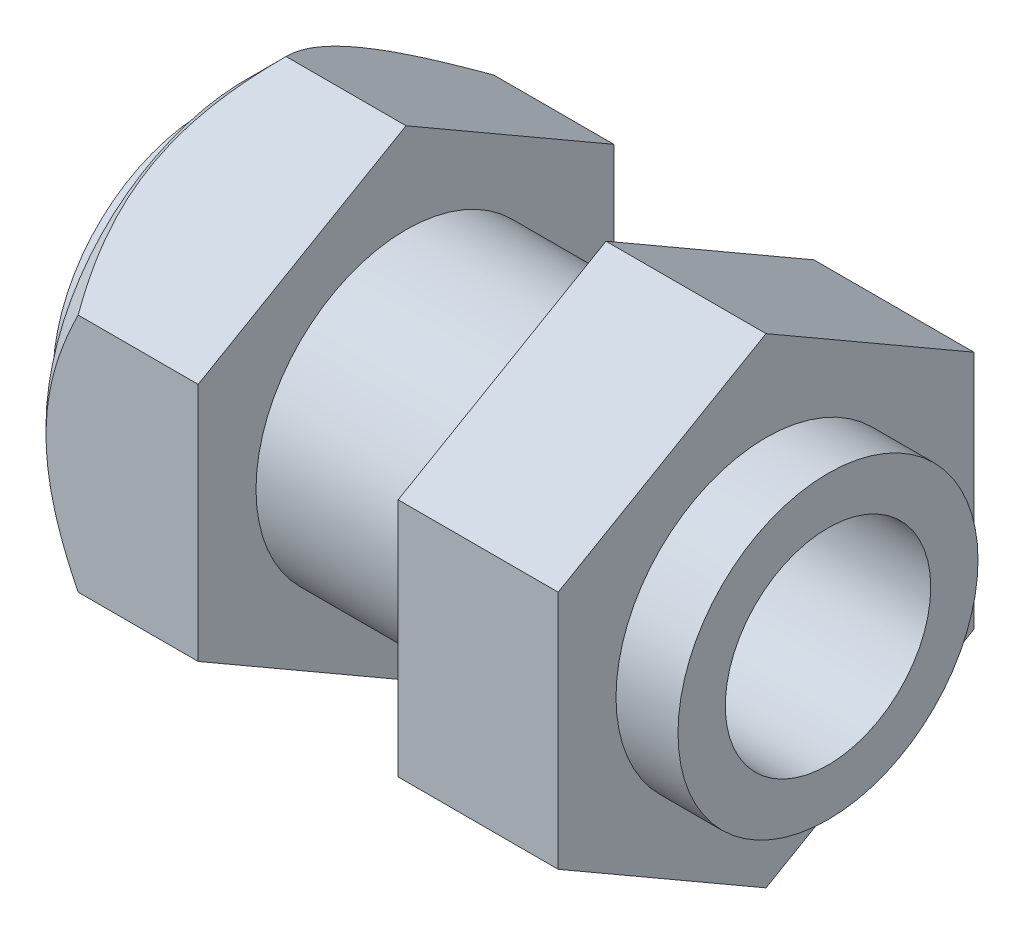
ISO-10303-21;
HEADER;
FILE_DESCRIPTION(('STEP AP214'),'2;1');
FILE_NAME('part.step','',(''),(''),'','','');
FILE_SCHEMA(('AUTOMOTIVE_DESIGN { 1 0 10303 214 1 1 1 1 }'));
ENDSEC;
DATA;
#1=APPLICATION_CONTEXT('core data for automotive mechanical design processes');
#2=APPLICATION_PROTOCOL_DEFINITION('international standard','automotive_design',2000,#1);
#3=PRODUCT_CONTEXT('',#1,'mechanical');
#4=PRODUCT('Part','Part','',(#3));
#5=PRODUCT_RELATED_PRODUCT_CATEGORY('part','',(#4));
#6=PRODUCT_DEFINITION_FORMATION('','',#4);
#7=PRODUCT_DEFINITION_CONTEXT('part definition',#1,'design');
#8=PRODUCT_DEFINITION('design','',#6,#7);
#9=PRODUCT_DEFINITION_SHAPE('','',#8);
#10=(LENGTH_UNIT() NAMED_UNIT(*) SI_UNIT(.MILLI.,.METRE.));
#11=(NAMED_UNIT(*) PLANE_ANGLE_UNIT() SI_UNIT($,.RADIAN.));
#12=(NAMED_UNIT(*) SI_UNIT($,.STERADIAN.) SOLID_ANGLE_UNIT());
#13=UNCERTAINTY_MEASURE_WITH_UNIT(LENGTH_MEASURE(1.E-05),#10,'distance_accuracy_value','');
#14=(GEOMETRIC_REPRESENTATION_CONTEXT(3) GLOBAL_UNCERTAINTY_ASSIGNED_CONTEXT((#13)) GLOBAL_UNIT_ASSIGNED_CONTEXT((#10,
#11,#12)) REPRESENTATION_CONTEXT('',''));
#15=CARTESIAN_POINT('',(0.,0.,0.));
#16=DIRECTION('',(0.,0.,1.));
#17=DIRECTION('',(1.,0.,0.));
#18=AXIS2_PLACEMENT_3D('',#15,#16,#17);
#19=CARTESIAN_POINT('',(-421.956854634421,-62.9264932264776,170.));
#20=DIRECTION('',(-1.,0.,0.));
#21=DIRECTION('',(0.,0.,1.));
#22=AXIS2_PLACEMENT_3D('',#19,#20,#21);
#23=PLANE('',#22);
#24=CARTESIAN_POINT('',(-421.956854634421,-75.1108396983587,170.));
#25=DIRECTION('',(1.,0.,0.));
#26=DIRECTION('',(0.,0.,-1.));
#27=AXIS2_PLACEMENT_3D('',#24,#25,#26);
#28=CIRCLE('',#27,7.50000000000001);
#29=CARTESIAN_POINT('',(-421.956854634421,-75.1108396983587,162.5));
#30=VERTEX_POINT('',#29);
#31=EDGE_CURVE('E198',#30,#30,#28,.T.);
#32=ORIENTED_EDGE('',*,*,#31,.F.);
#33=EDGE_LOOP('',(#32));
#34=FACE_BOUND('',#33,.T.);
#35=DIRECTION('',(0.,0.5,-0.866025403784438));
#36=VECTOR('',#35,1.);
#37=CARTESIAN_POINT('',(-421.956854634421,-63.0647530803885,169.920175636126));
#38=LINE('',#37,#36);
#39=CARTESIAN_POINT('',(-421.956854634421,-69.1108396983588,180.392304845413));
#40=VERTEX_POINT('',#39);
#41=CARTESIAN_POINT('',(-421.956854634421,-63.1108396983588,170.));
#42=VERTEX_POINT('',#41);
#43=EDGE_CURVE('E173',#40,#42,#38,.T.);
#44=ORIENTED_EDGE('',*,*,#43,.F.);
#45=DIRECTION('',(0.,1.,0.));
#46=VECTOR('',#45,1.);
#47=CARTESIAN_POINT('',(-421.956854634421,-62.9264932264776,180.392304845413));
#48=LINE('',#47,#46);
#49=CARTESIAN_POINT('',(-421.956854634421,-81.1108396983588,180.392304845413));
#50=VERTEX_POINT('',#49);
#51=EDGE_CURVE('E166',#50,#40,#48,.T.);
#52=ORIENTED_EDGE('',*,*,#51,.F.);
#53=DIRECTION('',(0.,0.5,0.866025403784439));
#54=VECTOR('',#53,1.);
#55=CARTESIAN_POINT('',(-421.956854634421,-81.0647530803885,180.472129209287));
#56=LINE('',#55,#54);
#57=CARTESIAN_POINT('',(-421.956854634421,-87.1108396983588,170.));
#58=VERTEX_POINT('',#57);
#59=EDGE_CURVE('E160',#58,#50,#56,.T.);
#60=ORIENTED_EDGE('',*,*,#59,.F.);
#61=DIRECTION('',(0.,-0.499999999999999,0.866025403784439));
#62=VECTOR('',#61,1.);
#63=CARTESIAN_POINT('',(-421.956854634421,-81.0647530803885,159.527870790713));
#64=LINE('',#63,#62);
#65=CARTESIAN_POINT('',(-421.956854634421,-81.1108396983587,159.607695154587));
#66=VERTEX_POINT('',#65);
#67=EDGE_CURVE('E146',#66,#58,#64,.T.);
#68=ORIENTED_EDGE('',*,*,#67,.F.);
#69=DIRECTION('',(0.,-1.,0.));
#70=VECTOR('',#69,1.);
#71=CARTESIAN_POINT('',(-421.956854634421,-62.9264932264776,159.607695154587));
#72=LINE('',#71,#70);
#73=CARTESIAN_POINT('',(-421.956854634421,-69.1108396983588,159.607695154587));
#74=VERTEX_POINT('',#73);
#75=EDGE_CURVE('E136',#74,#66,#72,.T.);
#76=ORIENTED_EDGE('',*,*,#75,.F.);
#77=DIRECTION('',(0.,-0.5,-0.866025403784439));
#78=VECTOR('',#77,1.);
#79=CARTESIAN_POINT('',(-421.956854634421,-63.0647530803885,170.079824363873));
#80=LINE('',#79,#78);
#81=EDGE_CURVE('E125',#42,#74,#80,.T.);
#82=ORIENTED_EDGE('',*,*,#81,.F.);
#83=EDGE_LOOP('',(#44,#52,#60,#68,#76,#82));
#84=FACE_BOUND('',#83,.T.);
#85=ADVANCED_FACE('F34',(#34,#84),#23,.F.);
#86=CARTESIAN_POINT('',(-445.956854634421,-75.1108396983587,170.));
#87=DIRECTION('',(1.,0.,0.));
#88=DIRECTION('',(0.,0.,-1.));
#89=AXIS2_PLACEMENT_3D('',#86,#87,#88);
#90=CONICAL_SURFACE('',#89,12.,0.785398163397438);
#91=CARTESIAN_POINT('',(-447.956854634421,-75.1108396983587,170.));
#92=DIRECTION('',(1.,0.,0.));
#93=DIRECTION('',(0.,0.,-1.));
#94=AXIS2_PLACEMENT_3D('',#91,#92,#93);
#95=CIRCLE('',#94,9.99999999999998);
#96=CARTESIAN_POINT('',(-447.956854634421,-75.1108396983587,160.));
#97=VERTEX_POINT('',#96);
#98=EDGE_CURVE('E201',#97,#97,#95,.F.);
#99=ORIENTED_EDGE('',*,*,#98,.F.);
#100=EDGE_LOOP('',(#99));
#101=FACE_BOUND('',#100,.T.);
#102=CARTESIAN_POINT('',(-441.805658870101,-87.4745415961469,180.392304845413));
#103=CARTESIAN_POINT('',(-442.03473558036,-87.1752221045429,180.392304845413));
#104=CARTESIAN_POINT('',(-442.261715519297,-86.8742720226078,180.392304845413));
#105=CARTESIAN_POINT('',(-442.710529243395,-86.2684506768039,180.392304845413));
#106=CARTESIAN_POINT('',(-442.932361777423,-85.9635784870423,180.392304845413));
#107=CARTESIAN_POINT('',(-443.371506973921,-85.3470235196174,180.392304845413));
#108=CARTESIAN_POINT('',(-443.588771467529,-85.0353063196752,180.392304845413));
#109=CARTESIAN_POINT('',(-444.015589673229,-84.4066538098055,180.392304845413));
#110=CARTESIAN_POINT('',(-444.22514391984,-84.0897188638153,180.392304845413));
#111=CARTESIAN_POINT('',(-444.647418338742,-83.430049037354,180.392304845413));
#112=CARTESIAN_POINT('',(-444.859537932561,-83.0869277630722,180.392304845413));
#113=CARTESIAN_POINT('',(-445.270395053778,-82.3926387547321,180.392304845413));
#114=CARTESIAN_POINT('',(-445.469130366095,-82.041469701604,180.392304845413));
#115=CARTESIAN_POINT('',(-445.848970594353,-81.331025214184,180.392304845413));
#116=CARTESIAN_POINT('',(-446.030127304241,-80.9717776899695,180.392304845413));
#117=CARTESIAN_POINT('',(-446.37075221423,-80.2432252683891,180.392304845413));
#118=CARTESIAN_POINT('',(-446.530230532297,-79.873925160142,180.392304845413));
#119=CARTESIAN_POINT('',(-446.808082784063,-79.1596533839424,180.392304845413));
#120=CARTESIAN_POINT('',(-446.928908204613,-78.81564518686,180.392304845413));
#121=CARTESIAN_POINT('',(-447.143008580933,-78.1189992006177,180.392304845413));
#122=CARTESIAN_POINT('',(-447.236281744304,-77.7663608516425,180.392304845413));
#123=CARTESIAN_POINT('',(-447.388726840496,-77.0606225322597,180.392304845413));
#124=CARTESIAN_POINT('',(-447.448508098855,-76.7076564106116,180.392304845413));
#125=CARTESIAN_POINT('',(-447.532745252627,-75.9975106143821,180.392304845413));
#126=CARTESIAN_POINT('',(-447.557208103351,-75.6403317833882,180.392304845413));
#127=CARTESIAN_POINT('',(-447.568799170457,-74.9401933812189,180.392304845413));
#128=CARTESIAN_POINT('',(-447.557433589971,-74.5972584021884,180.392304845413));
#129=CARTESIAN_POINT('',(-447.50141833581,-73.9141359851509,180.392304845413));
#130=CARTESIAN_POINT('',(-447.456765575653,-73.5739488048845,180.392304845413));
#131=CARTESIAN_POINT('',(-447.335916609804,-72.8930235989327,180.392304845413));
#132=CARTESIAN_POINT('',(-447.259169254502,-72.5523850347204,180.392304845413));
#133=CARTESIAN_POINT('',(-447.078342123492,-71.8785849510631,180.392304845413));
#134=CARTESIAN_POINT('',(-446.974264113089,-71.5454229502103,180.392304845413));
#135=CARTESIAN_POINT('',(-446.735522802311,-70.86507168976,180.392304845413));
#136=CARTESIAN_POINT('',(-446.599273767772,-70.5184450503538,180.392304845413));
#137=CARTESIAN_POINT('',(-446.305757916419,-69.8341288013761,180.392304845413));
#138=CARTESIAN_POINT('',(-446.148481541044,-69.4964433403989,180.392304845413));
#139=CARTESIAN_POINT('',(-445.81664346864,-68.8284008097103,180.392304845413));
#140=CARTESIAN_POINT('',(-445.642028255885,-68.4980705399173,180.392304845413));
#141=CARTESIAN_POINT('',(-445.279359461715,-67.8449872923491,180.392304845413));
#142=CARTESIAN_POINT('',(-445.091307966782,-67.522233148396,180.392304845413));
#143=CARTESIAN_POINT('',(-444.713963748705,-66.899108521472,180.392304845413));
#144=CARTESIAN_POINT('',(-444.525192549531,-66.5984205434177,180.392304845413));
#145=CARTESIAN_POINT('',(-444.139638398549,-66.0022097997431,180.392304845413));
#146=CARTESIAN_POINT('',(-443.942854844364,-65.7066874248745,180.392304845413));
#147=CARTESIAN_POINT('',(-443.544313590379,-65.1225133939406,180.392304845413));
#148=CARTESIAN_POINT('',(-443.342608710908,-64.8338255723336,180.392304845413));
#149=CARTESIAN_POINT('',(-442.933809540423,-64.2604067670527,180.392304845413));
#150=CARTESIAN_POINT('',(-442.726716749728,-63.9756747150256,180.392304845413));
#151=CARTESIAN_POINT('',(-442.517419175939,-63.6926013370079,180.392304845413));
#152=B_SPLINE_CURVE_WITH_KNOTS('',3,(#102,#103,#104,#105,#106,#107,#108,#109,#110,#111,#112,
#113,#114,#115,#116,#117,#118,#119,#120,#121,#122,#123,#124,#125,#126,#127,#128,#129,#130,#131,
#132,#133,#134,#135,#136,#137,#138,#139,#140,#141,#142,#143,#144,#145,#146,#147,#148,#149,#150,
#151),.UNSPECIFIED.,.F.,.F.,(4,2,2,2,2,2,2,2,2,2,2,2,2,2,2,2,2,2,2,2,2,2,2,2,4),(0.,
1.13077964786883,2.26183132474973,3.40162249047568,4.54133448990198,5.75127454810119,
6.96141436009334,8.16787282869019,9.37376625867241,10.4666485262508,11.5596018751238,
12.6319652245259,13.7041173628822,14.7318071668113,15.7595922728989,16.8058031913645,
17.8519465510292,18.9684161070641,20.0853949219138,21.2059352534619,22.3263019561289,
23.3912494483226,24.4562771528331,25.5127279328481,26.5688876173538),.UNSPECIFIED.);
#153=CARTESIAN_POINT('',(-445.956854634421,-81.1108396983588,180.392304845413));
#154=VERTEX_POINT('',#153);
#155=CARTESIAN_POINT('',(-445.956854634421,-69.1108396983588,180.392304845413));
#156=VERTEX_POINT('',#155);
#157=EDGE_CURVE('E47',#154,#156,#152,.T.);
#158=ORIENTED_EDGE('',*,*,#157,.T.);
#159=CARTESIAN_POINT('',(-445.9567391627,-69.1109551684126,180.392504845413));
#160=CARTESIAN_POINT('',(-446.05987795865,-69.0078015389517,180.213837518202));
#161=CARTESIAN_POINT('',(-446.159869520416,-68.9038400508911,180.03377093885));
#162=CARTESIAN_POINT('',(-446.352558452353,-68.6941756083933,179.670621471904));
#163=CARTESIAN_POINT('',(-446.44525183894,-68.5884717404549,179.487537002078));
#164=CARTESIAN_POINT('',(-446.622737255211,-68.3746982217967,179.117270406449));
#165=CARTESIAN_POINT('',(-446.707481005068,-68.2666184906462,178.930070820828));
#166=CARTESIAN_POINT('',(-446.867226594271,-68.0486838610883,178.552596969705));
#167=CARTESIAN_POINT('',(-446.942229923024,-67.9388292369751,178.362323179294));
#168=CARTESIAN_POINT('',(-447.080121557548,-67.7191111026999,177.981760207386));
#169=CARTESIAN_POINT('',(-447.143180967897,-67.6092745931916,177.791517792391));
#170=CARTESIAN_POINT('',(-447.25734423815,-67.3880618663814,177.408366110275));
#171=CARTESIAN_POINT('',(-447.308449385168,-67.2766858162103,177.215457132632));
#172=CARTESIAN_POINT('',(-447.397417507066,-67.0528703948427,176.827797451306));
#173=CARTESIAN_POINT('',(-447.435310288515,-66.9404340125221,176.633051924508));
#174=CARTESIAN_POINT('',(-447.497021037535,-66.7146173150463,176.241925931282));
#175=CARTESIAN_POINT('',(-447.520841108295,-66.6012371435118,176.045545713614));
#176=CARTESIAN_POINT('',(-447.560780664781,-66.3249390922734,175.566983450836));
#177=CARTESIAN_POINT('',(-447.569161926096,-66.1617225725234,175.284284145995));
#178=CARTESIAN_POINT('',(-447.555093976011,-65.8355847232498,174.719396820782));
#179=CARTESIAN_POINT('',(-447.532633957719,-65.6726635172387,174.43720901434));
#180=CARTESIAN_POINT('',(-447.458209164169,-65.3483568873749,173.875493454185));
#181=CARTESIAN_POINT('',(-447.40621139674,-65.1869733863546,173.595969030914));
#182=CARTESIAN_POINT('',(-447.275537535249,-64.8669802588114,173.041724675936));
#183=CARTESIAN_POINT('',(-447.196863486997,-64.7083704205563,172.767004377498));
#184=CARTESIAN_POINT('',(-447.035011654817,-64.4268174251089,172.27934028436));
#185=CARTESIAN_POINT('',(-446.95609150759,-64.3032506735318,172.065316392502));
#186=CARTESIAN_POINT('',(-446.785534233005,-64.0583352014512,171.641110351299));
#187=CARTESIAN_POINT('',(-446.693896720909,-63.9369865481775,171.430928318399));
#188=CARTESIAN_POINT('',(-446.49995870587,-63.6968894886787,171.015068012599));
#189=CARTESIAN_POINT('',(-446.397691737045,-63.5781342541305,170.809377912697));
#190=CARTESIAN_POINT('',(-446.183837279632,-63.3428226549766,170.401806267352));
#191=CARTESIAN_POINT('',(-446.072255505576,-63.2262649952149,170.199922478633));
#192=CARTESIAN_POINT('',(-445.9567391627,-63.1107242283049,169.9998));
#193=B_SPLINE_CURVE_WITH_KNOTS('',3,(#159,#160,#161,#162,#163,#164,#165,#166,#167,#168,#169,
#170,#171,#172,#173,#174,#175,#176,#177,#178,#179,#180,#181,#182,#183,#184,#185,#186,#187,#188,
#189,#190,#191,#192),.UNSPECIFIED.,.F.,.F.,(4,2,2,2,2,2,2,2,2,2,2,2,2,2,2,2,4),(0.,
0.691984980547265,1.38434508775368,2.08066945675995,2.77688722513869,3.46221813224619,
4.14747521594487,4.83117622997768,5.51477503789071,6.49287009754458,7.47130797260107,
8.45084086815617,9.43029866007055,10.208220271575,10.9861654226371,11.7617267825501,
12.5368157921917),.UNSPECIFIED.);
#194=CARTESIAN_POINT('',(-445.956854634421,-63.1108396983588,170.));
#195=VERTEX_POINT('',#194);
#196=EDGE_CURVE('E12',#156,#195,#193,.T.);
#197=ORIENTED_EDGE('',*,*,#196,.T.);
#198=CARTESIAN_POINT('',(-445.9567391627,-63.1107242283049,170.0002));
#199=CARTESIAN_POINT('',(-446.05987795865,-63.2138778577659,169.821532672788));
#200=CARTESIAN_POINT('',(-446.159869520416,-63.3178393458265,169.641466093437));
#201=CARTESIAN_POINT('',(-446.352558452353,-63.5275037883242,169.27831662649));
#202=CARTESIAN_POINT('',(-446.44525183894,-63.6332076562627,169.095232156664));
#203=CARTESIAN_POINT('',(-446.622737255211,-63.8469811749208,168.724965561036));
#204=CARTESIAN_POINT('',(-446.707481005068,-63.9550609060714,168.537765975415));
#205=CARTESIAN_POINT('',(-446.867226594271,-64.1729955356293,168.160292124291));
#206=CARTESIAN_POINT('',(-446.942229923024,-64.2828501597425,167.970018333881));
#207=CARTESIAN_POINT('',(-447.080121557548,-64.5025682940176,167.589455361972));
#208=CARTESIAN_POINT('',(-447.143180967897,-64.6124048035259,167.399212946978));
#209=CARTESIAN_POINT('',(-447.257344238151,-64.8336175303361,167.016061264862));
#210=CARTESIAN_POINT('',(-447.308449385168,-64.9449935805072,166.823152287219));
#211=CARTESIAN_POINT('',(-447.397417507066,-65.1688090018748,166.435492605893));
#212=CARTESIAN_POINT('',(-447.435310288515,-65.2812453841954,166.240747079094));
#213=CARTESIAN_POINT('',(-447.497021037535,-65.5070620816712,165.849621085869));
#214=CARTESIAN_POINT('',(-447.520841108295,-65.6204422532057,165.6532408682));
#215=CARTESIAN_POINT('',(-447.560780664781,-65.8967403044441,165.174678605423));
#216=CARTESIAN_POINT('',(-447.569161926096,-66.059956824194,164.891979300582));
#217=CARTESIAN_POINT('',(-447.555093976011,-66.3860946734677,164.327091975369));
#218=CARTESIAN_POINT('',(-447.532633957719,-66.5490158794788,164.044904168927));
#219=CARTESIAN_POINT('',(-447.458209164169,-66.8733225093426,163.483188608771));
#220=CARTESIAN_POINT('',(-447.40621139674,-67.0347060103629,163.203664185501));
#221=CARTESIAN_POINT('',(-447.275537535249,-67.3546991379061,162.649419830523));
#222=CARTESIAN_POINT('',(-447.196863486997,-67.5133089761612,162.374699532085));
#223=CARTESIAN_POINT('',(-447.035011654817,-67.7948619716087,161.887035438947));
#224=CARTESIAN_POINT('',(-446.95609150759,-67.9184287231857,161.673011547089));
#225=CARTESIAN_POINT('',(-446.785534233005,-68.1633441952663,161.248805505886));
#226=CARTESIAN_POINT('',(-446.693896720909,-68.28469284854,161.038623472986));
#227=CARTESIAN_POINT('',(-446.49995870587,-68.5247899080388,160.622763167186));
#228=CARTESIAN_POINT('',(-446.397691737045,-68.643545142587,160.417073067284));
#229=CARTESIAN_POINT('',(-446.183837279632,-68.8788567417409,160.009501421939));
#230=CARTESIAN_POINT('',(-446.072255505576,-68.9954144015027,159.80761763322));
#231=CARTESIAN_POINT('',(-445.9567391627,-69.1109551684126,159.607495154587));
#232=B_SPLINE_CURVE_WITH_KNOTS('',3,(#198,#199,#200,#201,#202,#203,#204,#205,#206,#207,#208,
#209,#210,#211,#212,#213,#214,#215,#216,#217,#218,#219,#220,#221,#222,#223,#224,#225,#226,#227,
#228,#229,#230,#231),.UNSPECIFIED.,.F.,.F.,(4,2,2,2,2,2,2,2,2,2,2,2,2,2,2,2,4),(0.,
0.691984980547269,1.38434508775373,2.08066945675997,2.77688722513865,3.46221813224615,
4.14747521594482,4.83117622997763,5.51477503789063,6.49287009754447,7.47130797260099,
8.45084086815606,9.43029866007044,10.2082202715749,10.986165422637,11.76172678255,
12.5368157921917),.UNSPECIFIED.);
#233=CARTESIAN_POINT('',(-445.956854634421,-69.1108396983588,159.607695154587));
#234=VERTEX_POINT('',#233);
#235=EDGE_CURVE('E204',#195,#234,#232,.T.);
#236=ORIENTED_EDGE('',*,*,#235,.T.);
#237=CARTESIAN_POINT('',(-441.805658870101,-87.4745415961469,159.607695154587));
#238=CARTESIAN_POINT('',(-442.03473558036,-87.1752221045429,159.607695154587));
#239=CARTESIAN_POINT('',(-442.261715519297,-86.8742720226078,159.607695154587));
#240=CARTESIAN_POINT('',(-442.710529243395,-86.2684506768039,159.607695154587));
#241=CARTESIAN_POINT('',(-442.932361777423,-85.9635784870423,159.607695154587));
#242=CARTESIAN_POINT('',(-443.371506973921,-85.3470235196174,159.607695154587));
#243=CARTESIAN_POINT('',(-443.588771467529,-85.0353063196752,159.607695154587));
#244=CARTESIAN_POINT('',(-444.015589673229,-84.4066538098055,159.607695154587));
#245=CARTESIAN_POINT('',(-444.22514391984,-84.0897188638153,159.607695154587));
#246=CARTESIAN_POINT('',(-444.647418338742,-83.4300490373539,159.607695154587));
#247=CARTESIAN_POINT('',(-444.859537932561,-83.0869277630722,159.607695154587));
#248=CARTESIAN_POINT('',(-445.270395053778,-82.392638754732,159.607695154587));
#249=CARTESIAN_POINT('',(-445.469130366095,-82.0414697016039,159.607695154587));
#250=CARTESIAN_POINT('',(-445.848970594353,-81.331025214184,159.607695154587));
#251=CARTESIAN_POINT('',(-446.030127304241,-80.9717776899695,159.607695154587));
#252=CARTESIAN_POINT('',(-446.370752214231,-80.2432252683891,159.607695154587));
#253=CARTESIAN_POINT('',(-446.530230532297,-79.873925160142,159.607695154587));
#254=CARTESIAN_POINT('',(-446.808082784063,-79.1596533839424,159.607695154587));
#255=CARTESIAN_POINT('',(-446.928908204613,-78.81564518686,159.607695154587));
#256=CARTESIAN_POINT('',(-447.143008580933,-78.1189992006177,159.607695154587));
#257=CARTESIAN_POINT('',(-447.236281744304,-77.7663608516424,159.607695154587));
#258=CARTESIAN_POINT('',(-447.388726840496,-77.0606225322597,159.607695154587));
#259=CARTESIAN_POINT('',(-447.448508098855,-76.7076564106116,159.607695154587));
#260=CARTESIAN_POINT('',(-447.532745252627,-75.9975106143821,159.607695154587));
#261=CARTESIAN_POINT('',(-447.557208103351,-75.6403317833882,159.607695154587));
#262=CARTESIAN_POINT('',(-447.568799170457,-74.9401933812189,159.607695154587));
#263=CARTESIAN_POINT('',(-447.557433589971,-74.5972584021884,159.607695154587));
#264=CARTESIAN_POINT('',(-447.50141833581,-73.9141359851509,159.607695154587));
#265=CARTESIAN_POINT('',(-447.456765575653,-73.5739488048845,159.607695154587));
#266=CARTESIAN_POINT('',(-447.335916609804,-72.8930235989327,159.607695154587));
#267=CARTESIAN_POINT('',(-447.259169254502,-72.5523850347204,159.607695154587));
#268=CARTESIAN_POINT('',(-447.078342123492,-71.8785849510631,159.607695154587));
#269=CARTESIAN_POINT('',(-446.974264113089,-71.5454229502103,159.607695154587));
#270=CARTESIAN_POINT('',(-446.735522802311,-70.86507168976,159.607695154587));
#271=CARTESIAN_POINT('',(-446.599273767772,-70.5184450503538,159.607695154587));
#272=CARTESIAN_POINT('',(-446.305757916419,-69.8341288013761,159.607695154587));
#273=CARTESIAN_POINT('',(-446.148481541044,-69.4964433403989,159.607695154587));
#274=CARTESIAN_POINT('',(-445.81664346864,-68.8284008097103,159.607695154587));
#275=CARTESIAN_POINT('',(-445.642028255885,-68.4980705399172,159.607695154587));
#276=CARTESIAN_POINT('',(-445.279359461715,-67.8449872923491,159.607695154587));
#277=CARTESIAN_POINT('',(-445.091307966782,-67.522233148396,159.607695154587));
#278=CARTESIAN_POINT('',(-444.713963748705,-66.899108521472,159.607695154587));
#279=CARTESIAN_POINT('',(-444.525192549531,-66.5984205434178,159.607695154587));
#280=CARTESIAN_POINT('',(-444.13963839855,-66.0022097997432,159.607695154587));
#281=CARTESIAN_POINT('',(-443.942854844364,-65.7066874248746,159.607695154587));
#282=CARTESIAN_POINT('',(-443.544313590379,-65.1225133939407,159.607695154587));
#283=CARTESIAN_POINT('',(-443.342608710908,-64.8338255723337,159.607695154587));
#284=CARTESIAN_POINT('',(-442.933809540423,-64.2604067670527,159.607695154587));
#285=CARTESIAN_POINT('',(-442.726716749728,-63.9756747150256,159.607695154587));
#286=CARTESIAN_POINT('',(-442.517419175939,-63.6926013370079,159.607695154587));
#287=B_SPLINE_CURVE_WITH_KNOTS('',3,(#237,#238,#239,#240,#241,#242,#243,#244,#245,#246,#247,
#248,#249,#250,#251,#252,#253,#254,#255,#256,#257,#258,#259,#260,#261,#262,#263,#264,#265,#266,
#267,#268,#269,#270,#271,#272,#273,#274,#275,#276,#277,#278,#279,#280,#281,#282,#283,#284,#285,
#286),.UNSPECIFIED.,.F.,.F.,(4,2,2,2,2,2,2,2,2,2,2,2,2,2,2,2,2,2,2,2,2,2,2,2,4),(0.,
1.13077964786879,2.26183132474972,3.40162249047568,4.54133448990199,5.75127454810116,
6.96141436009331,8.16787282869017,9.37376625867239,10.4666485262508,11.5596018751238,
12.6319652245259,13.7041173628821,14.7318071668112,15.7595922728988,16.8058031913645,
17.8519465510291,18.9684161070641,20.0853949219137,21.2059352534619,22.3263019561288,
23.3912494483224,24.4562771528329,25.512727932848,26.5688876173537),.UNSPECIFIED.);
#288=CARTESIAN_POINT('',(-445.956854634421,-81.1108396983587,159.607695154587));
#289=VERTEX_POINT('',#288);
#290=EDGE_CURVE('E211',#234,#289,#287,.F.);
#291=ORIENTED_EDGE('',*,*,#290,.T.);
#292=CARTESIAN_POINT('',(-445.9567391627,-81.1107242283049,159.607495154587));
#293=CARTESIAN_POINT('',(-446.05987795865,-81.2138778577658,159.786162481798));
#294=CARTESIAN_POINT('',(-446.159869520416,-81.3178393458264,159.96622906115));
#295=CARTESIAN_POINT('',(-446.352558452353,-81.5275037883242,160.329378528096));
#296=CARTESIAN_POINT('',(-446.44525183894,-81.6332076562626,160.512462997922));
#297=CARTESIAN_POINT('',(-446.622737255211,-81.8469811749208,160.882729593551));
#298=CARTESIAN_POINT('',(-446.707481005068,-81.9550609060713,161.069929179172));
#299=CARTESIAN_POINT('',(-446.867226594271,-82.1729955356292,161.447403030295));
#300=CARTESIAN_POINT('',(-446.942229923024,-82.2828501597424,161.637676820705));
#301=CARTESIAN_POINT('',(-447.080121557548,-82.5025682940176,162.018239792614));
#302=CARTESIAN_POINT('',(-447.143180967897,-82.6124048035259,162.208482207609));
#303=CARTESIAN_POINT('',(-447.25734423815,-82.8336175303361,162.591633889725));
#304=CARTESIAN_POINT('',(-447.308449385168,-82.9449935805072,162.784542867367));
#305=CARTESIAN_POINT('',(-447.397417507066,-83.1688090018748,163.172202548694));
#306=CARTESIAN_POINT('',(-447.435310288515,-83.2812453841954,163.366948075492));
#307=CARTESIAN_POINT('',(-447.497021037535,-83.5070620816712,163.758074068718));
#308=CARTESIAN_POINT('',(-447.520841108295,-83.6204422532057,163.954454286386));
#309=CARTESIAN_POINT('',(-447.560780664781,-83.896740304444,164.433016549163));
#310=CARTESIAN_POINT('',(-447.569161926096,-84.059956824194,164.715715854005));
#311=CARTESIAN_POINT('',(-447.555093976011,-84.3860946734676,165.280603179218));
#312=CARTESIAN_POINT('',(-447.532633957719,-84.5490158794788,165.56279098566));
#313=CARTESIAN_POINT('',(-447.458209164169,-84.8733225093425,166.124506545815));
#314=CARTESIAN_POINT('',(-447.40621139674,-85.0347060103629,166.404030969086));
#315=CARTESIAN_POINT('',(-447.275537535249,-85.354699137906,166.958275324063));
#316=CARTESIAN_POINT('',(-447.196863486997,-85.5133089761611,167.232995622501));
#317=CARTESIAN_POINT('',(-447.035011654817,-85.7948619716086,167.72065971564));
#318=CARTESIAN_POINT('',(-446.95609150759,-85.9184287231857,167.934683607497));
#319=CARTESIAN_POINT('',(-446.785534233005,-86.1633441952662,168.358889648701));
#320=CARTESIAN_POINT('',(-446.693896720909,-86.28469284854,168.569071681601));
#321=CARTESIAN_POINT('',(-446.49995870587,-86.5247899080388,168.984931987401));
#322=CARTESIAN_POINT('',(-446.397691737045,-86.643545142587,169.190622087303));
#323=CARTESIAN_POINT('',(-446.183837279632,-86.8788567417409,169.598193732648));
#324=CARTESIAN_POINT('',(-446.072255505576,-86.9954144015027,169.800077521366));
#325=CARTESIAN_POINT('',(-445.9567391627,-87.1109551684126,170.0002));
#326=B_SPLINE_CURVE_WITH_KNOTS('',3,(#292,#293,#294,#295,#296,#297,#298,#299,#300,#301,#302,
#303,#304,#305,#306,#307,#308,#309,#310,#311,#312,#313,#314,#315,#316,#317,#318,#319,#320,#321,
#322,#323,#324,#325),.UNSPECIFIED.,.F.,.F.,(4,2,2,2,2,2,2,2,2,2,2,2,2,2,2,2,4),(0.,
0.691984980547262,1.38434508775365,2.08066945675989,2.77688722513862,3.46221813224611,
4.14747521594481,4.83117622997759,5.51477503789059,6.49287009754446,7.47130797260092,
8.45084086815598,9.43029866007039,10.2082202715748,10.986165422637,11.7617267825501,
12.5368157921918),.UNSPECIFIED.);
#327=CARTESIAN_POINT('',(-445.956854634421,-87.1108396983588,170.));
#328=VERTEX_POINT('',#327);
#329=EDGE_CURVE('E313',#289,#328,#326,.T.);
#330=ORIENTED_EDGE('',*,*,#329,.T.);
#331=CARTESIAN_POINT('',(-445.9567391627,-87.1109551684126,169.9998));
#332=CARTESIAN_POINT('',(-446.059877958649,-87.0078015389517,170.178467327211));
#333=CARTESIAN_POINT('',(-446.159869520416,-86.9038400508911,170.358533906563));
#334=CARTESIAN_POINT('',(-446.352558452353,-86.6941756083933,170.72168337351));
#335=CARTESIAN_POINT('',(-446.44525183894,-86.5884717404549,170.904767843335));
#336=CARTESIAN_POINT('',(-446.622737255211,-86.3746982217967,171.275034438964));
#337=CARTESIAN_POINT('',(-446.707481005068,-86.2666184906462,171.462234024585));
#338=CARTESIAN_POINT('',(-446.867226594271,-86.0486838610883,171.839707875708));
#339=CARTESIAN_POINT('',(-446.942229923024,-85.9388292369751,172.029981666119));
#340=CARTESIAN_POINT('',(-447.080121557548,-85.7191111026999,172.410544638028));
#341=CARTESIAN_POINT('',(-447.143180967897,-85.6092745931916,172.600787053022));
#342=CARTESIAN_POINT('',(-447.25734423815,-85.3880618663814,172.983938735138));
#343=CARTESIAN_POINT('',(-447.308449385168,-85.2766858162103,173.176847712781));
#344=CARTESIAN_POINT('',(-447.397417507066,-85.0528703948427,173.564507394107));
#345=CARTESIAN_POINT('',(-447.435310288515,-84.9404340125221,173.759252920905));
#346=CARTESIAN_POINT('',(-447.497021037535,-84.7146173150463,174.150378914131));
#347=CARTESIAN_POINT('',(-447.520841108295,-84.6012371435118,174.346759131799));
#348=CARTESIAN_POINT('',(-447.56078066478,-84.3249390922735,174.825321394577));
#349=CARTESIAN_POINT('',(-447.569161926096,-84.1617225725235,175.108020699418));
#350=CARTESIAN_POINT('',(-447.555093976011,-83.8355847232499,175.672908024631));
#351=CARTESIAN_POINT('',(-447.532633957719,-83.6726635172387,175.955095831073));
#352=CARTESIAN_POINT('',(-447.458209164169,-83.348356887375,176.516811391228));
#353=CARTESIAN_POINT('',(-447.40621139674,-83.1869733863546,176.796335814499));
#354=CARTESIAN_POINT('',(-447.275537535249,-82.8669802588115,177.350580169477));
#355=CARTESIAN_POINT('',(-447.196863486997,-82.7083704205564,177.625300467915));
#356=CARTESIAN_POINT('',(-447.035011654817,-82.4268174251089,178.112964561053));
#357=CARTESIAN_POINT('',(-446.95609150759,-82.3032506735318,178.326988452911));
#358=CARTESIAN_POINT('',(-446.785534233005,-82.0583352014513,178.751194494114));
#359=CARTESIAN_POINT('',(-446.693896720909,-81.9369865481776,178.961376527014));
#360=CARTESIAN_POINT('',(-446.49995870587,-81.6968894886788,179.377236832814));
#361=CARTESIAN_POINT('',(-446.397691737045,-81.5781342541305,179.582926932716));
#362=CARTESIAN_POINT('',(-446.183837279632,-81.3428226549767,179.990498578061));
#363=CARTESIAN_POINT('',(-446.072255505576,-81.2262649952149,180.19238236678));
#364=CARTESIAN_POINT('',(-445.9567391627,-81.1107242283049,180.392504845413));
#365=B_SPLINE_CURVE_WITH_KNOTS('',3,(#331,#332,#333,#334,#335,#336,#337,#338,#339,#340,#341,
#342,#343,#344,#345,#346,#347,#348,#349,#350,#351,#352,#353,#354,#355,#356,#357,#358,#359,#360,
#361,#362,#363,#364),.UNSPECIFIED.,.F.,.F.,(4,2,2,2,2,2,2,2,2,2,2,2,2,2,2,2,4),(0.,
0.691984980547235,1.38434508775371,2.08066945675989,2.77688722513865,3.46221813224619,
4.14747521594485,4.8311762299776,5.51477503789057,6.49287009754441,7.47130797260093,
8.450840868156,9.43029866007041,10.2082202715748,10.9861654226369,11.76172678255,
12.5368157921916),.UNSPECIFIED.);
#366=EDGE_CURVE('E310',#328,#154,#365,.T.);
#367=ORIENTED_EDGE('',*,*,#366,.T.);
#368=EDGE_LOOP('',(#158,#197,#236,#291,#330,#367));
#369=FACE_BOUND('',#368,.T.);
#370=ADVANCED_FACE('F36',(#101,#369),#90,.T.);
#371=CARTESIAN_POINT('',(-429.956854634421,-75.1108396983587,170.));
#372=DIRECTION('',(1.,0.,0.));
#373=DIRECTION('',(0.,0.,-1.));
#374=AXIS2_PLACEMENT_3D('',#371,#372,#373);
#375=CYLINDRICAL_SURFACE('',#374,7.50000000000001);
#376=CARTESIAN_POINT('',(-418.857974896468,-75.1108396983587,170.));
#377=DIRECTION('',(1.,0.,0.));
#378=DIRECTION('',(0.,0.,-1.));
#379=AXIS2_PLACEMENT_3D('',#376,#377,#378);
#380=CIRCLE('',#379,7.50000000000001);
#381=CARTESIAN_POINT('',(-418.857974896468,-75.1108396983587,162.5));
#382=VERTEX_POINT('',#381);
#383=EDGE_CURVE('E195',#382,#382,#380,.T.);
#384=ORIENTED_EDGE('',*,*,#383,.F.);
#385=EDGE_LOOP('',(#384));
#386=FACE_BOUND('',#385,.T.);
#387=ORIENTED_EDGE('',*,*,#31,.T.);
#388=EDGE_LOOP('',(#387));
#389=FACE_BOUND('',#388,.T.);
#390=ADVANCED_FACE('F257',(#386,#389),#375,.T.);
#391=CARTESIAN_POINT('',(-418.857974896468,-69.9740995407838,170.));
#392=DIRECTION('',(-1.,0.,0.));
#393=DIRECTION('',(0.,0.,1.));
#394=AXIS2_PLACEMENT_3D('',#391,#392,#393);
#395=PLANE('',#394);
#396=CARTESIAN_POINT('',(-418.857974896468,-75.1108396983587,170.));
#397=DIRECTION('',(1.,0.,0.));
#398=DIRECTION('',(0.,0.,-1.));
#399=AXIS2_PLACEMENT_3D('',#396,#397,#398);
#400=CIRCLE('',#399,5.13674015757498);
#401=CARTESIAN_POINT('',(-418.857974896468,-75.1108396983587,164.863259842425));
#402=VERTEX_POINT('',#401);
#403=EDGE_CURVE('E192',#402,#402,#400,.T.);
#404=ORIENTED_EDGE('',*,*,#403,.F.);
#405=EDGE_LOOP('',(#404));
#406=FACE_BOUND('',#405,.T.);
#407=ORIENTED_EDGE('',*,*,#383,.T.);
#408=EDGE_LOOP('',(#407));
#409=FACE_BOUND('',#408,.T.);
#410=ADVANCED_FACE('F253',(#406,#409),#395,.F.);
#411=CARTESIAN_POINT('',(-429.956854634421,-75.1108396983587,170.));
#412=DIRECTION('',(1.,0.,0.));
#413=DIRECTION('',(0.,0.,-1.));
#414=AXIS2_PLACEMENT_3D('',#411,#412,#413);
#415=CYLINDRICAL_SURFACE('',#414,5.13674015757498);
#416=CARTESIAN_POINT('',(-449.949312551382,-75.1108396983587,170.));
#417=DIRECTION('',(1.,0.,0.));
#418=DIRECTION('',(0.,0.,-1.));
#419=AXIS2_PLACEMENT_3D('',#416,#417,#418);
#420=CIRCLE('',#419,5.13674015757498);
#421=CARTESIAN_POINT('',(-449.949312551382,-75.1108396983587,164.863259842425));
#422=VERTEX_POINT('',#421);
#423=EDGE_CURVE('E189',#422,#422,#420,.T.);
#424=ORIENTED_EDGE('',*,*,#423,.F.);
#425=EDGE_LOOP('',(#424));
#426=FACE_BOUND('',#425,.T.);
#427=ORIENTED_EDGE('',*,*,#403,.T.);
#428=EDGE_LOOP('',(#427));
#429=FACE_BOUND('',#428,.T.);
#430=ADVANCED_FACE('F249',(#426,#429),#415,.F.);
#431=CARTESIAN_POINT('',(-449.949312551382,-69.9740995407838,170.));
#432=DIRECTION('',(1.,0.,0.));
#433=DIRECTION('',(0.,0.,-1.));
#434=AXIS2_PLACEMENT_3D('',#431,#432,#433);
#435=PLANE('',#434);
#436=CARTESIAN_POINT('',(-449.949312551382,-75.1108396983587,170.));
#437=DIRECTION('',(1.,0.,0.));
#438=DIRECTION('',(0.,0.,-1.));
#439=AXIS2_PLACEMENT_3D('',#436,#437,#438);
#440=CIRCLE('',#439,7.65411866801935);
#441=CARTESIAN_POINT('',(-449.949312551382,-75.1108396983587,162.345881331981));
#442=VERTEX_POINT('',#441);
#443=EDGE_CURVE('E186',#442,#442,#440,.T.);
#444=ORIENTED_EDGE('',*,*,#443,.F.);
#445=EDGE_LOOP('',(#444));
#446=FACE_BOUND('',#445,.T.);
#447=ORIENTED_EDGE('',*,*,#423,.T.);
#448=EDGE_LOOP('',(#447));
#449=FACE_BOUND('',#448,.T.);
#450=ADVANCED_FACE('F245',(#446,#449),#435,.F.);
#451=CARTESIAN_POINT('',(-429.956854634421,-75.1108396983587,170.));
#452=DIRECTION('',(1.,0.,0.));
#453=DIRECTION('',(0.,0.,-1.));
#454=AXIS2_PLACEMENT_3D('',#451,#452,#453);
#455=CYLINDRICAL_SURFACE('',#454,7.65411866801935);
#456=CARTESIAN_POINT('',(-447.956854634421,-75.1108396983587,170.));
#457=DIRECTION('',(1.,0.,0.));
#458=DIRECTION('',(0.,0.,-1.));
#459=AXIS2_PLACEMENT_3D('',#456,#457,#458);
#460=CIRCLE('',#459,7.65411866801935);
#461=CARTESIAN_POINT('',(-447.956854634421,-75.1108396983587,162.345881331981));
#462=VERTEX_POINT('',#461);
#463=EDGE_CURVE('E183',#462,#462,#460,.T.);
#464=ORIENTED_EDGE('',*,*,#463,.F.);
#465=EDGE_LOOP('',(#464));
#466=FACE_BOUND('',#465,.T.);
#467=ORIENTED_EDGE('',*,*,#443,.T.);
#468=EDGE_LOOP('',(#467));
#469=FACE_BOUND('',#468,.T.);
#470=ADVANCED_FACE('F241',(#466,#469),#455,.T.);
#471=CARTESIAN_POINT('',(-447.956854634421,-67.4567210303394,170.));
#472=DIRECTION('',(1.,0.,0.));
#473=DIRECTION('',(0.,0.,-1.));
#474=AXIS2_PLACEMENT_3D('',#471,#472,#473);
#475=PLANE('',#474);
#476=ORIENTED_EDGE('',*,*,#98,.T.);
#477=EDGE_LOOP('',(#476));
#478=FACE_BOUND('',#477,.T.);
#479=ORIENTED_EDGE('',*,*,#463,.T.);
#480=EDGE_LOOP('',(#479));
#481=FACE_BOUND('',#480,.T.);
#482=ADVANCED_FACE('F238',(#478,#481),#475,.F.);
#483=CARTESIAN_POINT('',(-418.857974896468,-63.1108396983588,170.));
#484=DIRECTION('',(0.,0.866025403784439,-0.5));
#485=DIRECTION('',(0.,0.5,0.866025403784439));
#486=AXIS2_PLACEMENT_3D('',#483,#484,#485);
#487=PLANE('',#486);
#488=DIRECTION('',(0.,-0.5,-0.866025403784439));
#489=VECTOR('',#488,1.);
#490=CARTESIAN_POINT('',(-439.956854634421,-63.1108396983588,170.));
#491=LINE('',#490,#489);
#492=CARTESIAN_POINT('',(-439.956854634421,-63.1108396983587,170.));
#493=VERTEX_POINT('',#492);
#494=CARTESIAN_POINT('',(-439.956854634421,-69.1108396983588,159.607695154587));
#495=VERTEX_POINT('',#494);
#496=EDGE_CURVE('E131',#493,#495,#491,.T.);
#497=ORIENTED_EDGE('',*,*,#496,.T.);
#498=DIRECTION('',(-1.,0.,0.));
#499=VECTOR('',#498,1.);
#500=CARTESIAN_POINT('',(-418.857974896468,-69.1108396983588,159.607695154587));
#501=LINE('',#500,#499);
#502=EDGE_CURVE('E142',#495,#234,#501,.T.);
#503=ORIENTED_EDGE('',*,*,#502,.T.);
#504=ORIENTED_EDGE('',*,*,#235,.F.);
#505=DIRECTION('',(-1.,0.,0.));
#506=VECTOR('',#505,1.);
#507=CARTESIAN_POINT('',(-418.857974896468,-63.1108396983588,170.));
#508=LINE('',#507,#506);
#509=EDGE_CURVE('E299',#493,#195,#508,.T.);
#510=ORIENTED_EDGE('',*,*,#509,.F.);
#511=EDGE_LOOP('',(#497,#503,#504,#510));
#512=FACE_BOUND('',#511,.T.);
#513=ADVANCED_FACE('F219',(#512),#487,.T.);
#514=CARTESIAN_POINT('',(-418.857974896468,-69.1108396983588,159.607695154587));
#515=DIRECTION('',(0.,0.,-1.));
#516=DIRECTION('',(-1.,0.,0.));
#517=AXIS2_PLACEMENT_3D('',#514,#515,#516);
#518=PLANE('',#517);
#519=DIRECTION('',(0.,-1.,0.));
#520=VECTOR('',#519,1.);
#521=CARTESIAN_POINT('',(-439.956854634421,-63.1108396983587,159.607695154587));
#522=LINE('',#521,#520);
#523=CARTESIAN_POINT('',(-439.956854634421,-81.1108396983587,159.607695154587));
#524=VERTEX_POINT('',#523);
#525=EDGE_CURVE('E147',#495,#524,#522,.T.);
#526=ORIENTED_EDGE('',*,*,#525,.T.);
#527=DIRECTION('',(-1.,0.,0.));
#528=VECTOR('',#527,1.);
#529=CARTESIAN_POINT('',(-418.857974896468,-81.1108396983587,159.607695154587));
#530=LINE('',#529,#528);
#531=EDGE_CURVE('E141',#524,#289,#530,.T.);
#532=ORIENTED_EDGE('',*,*,#531,.T.);
#533=ORIENTED_EDGE('',*,*,#290,.F.);
#534=ORIENTED_EDGE('',*,*,#502,.F.);
#535=EDGE_LOOP('',(#526,#532,#533,#534));
#536=FACE_BOUND('',#535,.T.);
#537=ADVANCED_FACE('F341',(#536),#518,.T.);
#538=CARTESIAN_POINT('',(-418.857974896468,-81.1108396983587,159.607695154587));
#539=DIRECTION('',(0.,-0.866025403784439,-0.499999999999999));
#540=DIRECTION('',(0.,0.499999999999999,-0.866025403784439));
#541=AXIS2_PLACEMENT_3D('',#538,#539,#540);
#542=PLANE('',#541);
#543=DIRECTION('',(0.,-0.499999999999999,0.866025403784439));
#544=VECTOR('',#543,1.);
#545=CARTESIAN_POINT('',(-439.956854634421,-81.1108396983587,159.607695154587));
#546=LINE('',#545,#544);
#547=CARTESIAN_POINT('',(-439.956854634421,-87.1108396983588,170.));
#548=VERTEX_POINT('',#547);
#549=EDGE_CURVE('E149',#524,#548,#546,.T.);
#550=ORIENTED_EDGE('',*,*,#549,.T.);
#551=DIRECTION('',(-1.,0.,0.));
#552=VECTOR('',#551,1.);
#553=CARTESIAN_POINT('',(-418.857974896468,-87.1108396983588,170.));
#554=LINE('',#553,#552);
#555=EDGE_CURVE('E293',#548,#328,#554,.T.);
#556=ORIENTED_EDGE('',*,*,#555,.T.);
#557=ORIENTED_EDGE('',*,*,#329,.F.);
#558=ORIENTED_EDGE('',*,*,#531,.F.);
#559=EDGE_LOOP('',(#550,#556,#557,#558));
#560=FACE_BOUND('',#559,.T.);
#561=ADVANCED_FACE('F334',(#560),#542,.T.);
#562=CARTESIAN_POINT('',(-418.857974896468,-87.1108396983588,170.));
#563=DIRECTION('',(0.,-0.866025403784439,0.5));
#564=DIRECTION('',(0.,-0.5,-0.866025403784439));
#565=AXIS2_PLACEMENT_3D('',#562,#563,#564);
#566=PLANE('',#565);
#567=DIRECTION('',(0.,0.5,0.866025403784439));
#568=VECTOR('',#567,1.);
#569=CARTESIAN_POINT('',(-439.956854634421,-81.1108396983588,180.392304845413));
#570=LINE('',#569,#568);
#571=CARTESIAN_POINT('',(-439.956854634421,-81.1108396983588,180.392304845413));
#572=VERTEX_POINT('',#571);
#573=EDGE_CURVE('E158',#548,#572,#570,.T.);
#574=ORIENTED_EDGE('',*,*,#573,.T.);
#575=DIRECTION('',(-1.,0.,0.));
#576=VECTOR('',#575,1.);
#577=CARTESIAN_POINT('',(-418.857974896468,-81.1108396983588,180.392304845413));
#578=LINE('',#577,#576);
#579=EDGE_CURVE('E289',#572,#154,#578,.T.);
#580=ORIENTED_EDGE('',*,*,#579,.T.);
#581=ORIENTED_EDGE('',*,*,#366,.F.);
#582=ORIENTED_EDGE('',*,*,#555,.F.);
#583=EDGE_LOOP('',(#574,#580,#581,#582));
#584=FACE_BOUND('',#583,.T.);
#585=ADVANCED_FACE('F330',(#584),#566,.T.);
#586=CARTESIAN_POINT('',(-418.857974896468,-81.1108396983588,180.392304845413));
#587=DIRECTION('',(0.,0.,1.));
#588=DIRECTION('',(1.,0.,0.));
#589=AXIS2_PLACEMENT_3D('',#586,#587,#588);
#590=PLANE('',#589);
#591=DIRECTION('',(0.,1.,0.));
#592=VECTOR('',#591,1.);
#593=CARTESIAN_POINT('',(-439.956854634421,-63.1108396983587,180.392304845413));
#594=LINE('',#593,#592);
#595=CARTESIAN_POINT('',(-439.956854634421,-69.1108396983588,180.392304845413));
#596=VERTEX_POINT('',#595);
#597=EDGE_CURVE('E164',#572,#596,#594,.T.);
#598=ORIENTED_EDGE('',*,*,#597,.T.);
#599=DIRECTION('',(-1.,0.,0.));
#600=VECTOR('',#599,1.);
#601=CARTESIAN_POINT('',(-418.857974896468,-69.1108396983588,180.392304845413));
#602=LINE('',#601,#600);
#603=EDGE_CURVE('E283',#596,#156,#602,.T.);
#604=ORIENTED_EDGE('',*,*,#603,.T.);
#605=ORIENTED_EDGE('',*,*,#157,.F.);
#606=ORIENTED_EDGE('',*,*,#579,.F.);
#607=EDGE_LOOP('',(#598,#604,#605,#606));
#608=FACE_BOUND('',#607,.T.);
#609=ADVANCED_FACE('F269',(#608),#590,.T.);
#610=CARTESIAN_POINT('',(-418.857974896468,-69.1108396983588,180.392304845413));
#611=DIRECTION('',(0.,0.866025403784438,0.5));
#612=DIRECTION('',(0.,-0.5,0.866025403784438));
#613=AXIS2_PLACEMENT_3D('',#610,#611,#612);
#614=PLANE('',#613);
#615=DIRECTION('',(0.,0.5,-0.866025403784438));
#616=VECTOR('',#615,1.);
#617=CARTESIAN_POINT('',(-439.956854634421,-63.1108396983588,170.));
#618=LINE('',#617,#616);
#619=EDGE_CURVE('E170',#596,#493,#618,.T.);
#620=ORIENTED_EDGE('',*,*,#619,.T.);
#621=ORIENTED_EDGE('',*,*,#509,.T.);
#622=ORIENTED_EDGE('',*,*,#196,.F.);
#623=ORIENTED_EDGE('',*,*,#603,.F.);
#624=EDGE_LOOP('',(#620,#621,#622,#623));
#625=FACE_BOUND('',#624,.T.);
#626=ADVANCED_FACE('F229',(#625),#614,.T.);
#627=CARTESIAN_POINT('',(-429.956854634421,-67.6108396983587,170.));
#628=DIRECTION('',(1.,0.,0.));
#629=DIRECTION('',(0.,0.,-1.));
#630=AXIS2_PLACEMENT_3D('',#627,#628,#629);
#631=PLANE('',#630);
#632=CARTESIAN_POINT('',(-429.956854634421,-75.1108396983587,170.));
#633=DIRECTION('',(1.,0.,0.));
#634=DIRECTION('',(0.,0.,-1.));
#635=AXIS2_PLACEMENT_3D('',#632,#633,#634);
#636=CIRCLE('',#635,7.50000000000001);
#637=CARTESIAN_POINT('',(-429.956854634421,-75.1108396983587,162.5));
#638=VERTEX_POINT('',#637);
#639=EDGE_CURVE('E177',#638,#638,#636,.T.);
#640=ORIENTED_EDGE('',*,*,#639,.T.);
#641=EDGE_LOOP('',(#640));
#642=FACE_BOUND('',#641,.T.);
#643=DIRECTION('',(0.,-0.5,0.866025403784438));
#644=VECTOR('',#643,1.);
#645=CARTESIAN_POINT('',(-429.956854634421,-64.2358396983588,171.948557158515));
#646=LINE('',#645,#644);
#647=CARTESIAN_POINT('',(-429.956854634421,-63.1108396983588,170.));
#648=VERTEX_POINT('',#647);
#649=CARTESIAN_POINT('',(-429.956854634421,-69.1108396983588,180.392304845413));
#650=VERTEX_POINT('',#649);
#651=EDGE_CURVE('E175',#648,#650,#646,.T.);
#652=ORIENTED_EDGE('',*,*,#651,.F.);
#653=DIRECTION('',(0.,0.5,0.866025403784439));
#654=VECTOR('',#653,1.);
#655=CARTESIAN_POINT('',(-429.956854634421,-64.2358396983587,168.051442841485));
#656=LINE('',#655,#654);
#657=CARTESIAN_POINT('',(-429.956854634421,-69.1108396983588,159.607695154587));
#658=VERTEX_POINT('',#657);
#659=EDGE_CURVE('E130',#658,#648,#656,.T.);
#660=ORIENTED_EDGE('',*,*,#659,.F.);
#661=DIRECTION('',(0.,1.,0.));
#662=VECTOR('',#661,1.);
#663=CARTESIAN_POINT('',(-429.956854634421,-67.6108396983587,159.607695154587));
#664=LINE('',#663,#662);
#665=CARTESIAN_POINT('',(-429.956854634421,-81.1108396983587,159.607695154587));
#666=VERTEX_POINT('',#665);
#667=EDGE_CURVE('E139',#666,#658,#664,.T.);
#668=ORIENTED_EDGE('',*,*,#667,.F.);
#669=DIRECTION('',(0.,0.499999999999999,-0.866025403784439));
#670=VECTOR('',#669,1.);
#671=CARTESIAN_POINT('',(-429.956854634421,-82.2358396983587,161.556252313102));
#672=LINE('',#671,#670);
#673=CARTESIAN_POINT('',(-429.956854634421,-87.1108396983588,170.));
#674=VERTEX_POINT('',#673);
#675=EDGE_CURVE('E156',#674,#666,#672,.T.);
#676=ORIENTED_EDGE('',*,*,#675,.F.);
#677=DIRECTION('',(0.,-0.5,-0.866025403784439));
#678=VECTOR('',#677,1.);
#679=CARTESIAN_POINT('',(-429.956854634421,-82.2358396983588,178.443747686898));
#680=LINE('',#679,#678);
#681=CARTESIAN_POINT('',(-429.956854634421,-81.1108396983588,180.392304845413));
#682=VERTEX_POINT('',#681);
#683=EDGE_CURVE('E162',#682,#674,#680,.T.);
#684=ORIENTED_EDGE('',*,*,#683,.F.);
#685=DIRECTION('',(0.,-1.,0.));
#686=VECTOR('',#685,1.);
#687=CARTESIAN_POINT('',(-429.956854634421,-67.6108396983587,180.392304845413));
#688=LINE('',#687,#686);
#689=EDGE_CURVE('E168',#650,#682,#688,.T.);
#690=ORIENTED_EDGE('',*,*,#689,.F.);
#691=EDGE_LOOP('',(#652,#660,#668,#676,#684,#690));
#692=FACE_BOUND('',#691,.T.);
#693=ADVANCED_FACE('F233',(#642,#692),#631,.F.);
#694=CARTESIAN_POINT('',(-429.956854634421,-75.1108396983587,170.));
#695=DIRECTION('',(1.,0.,0.));
#696=DIRECTION('',(0.,0.,-1.));
#697=AXIS2_PLACEMENT_3D('',#694,#695,#696);
#698=CYLINDRICAL_SURFACE('',#697,7.50000000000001);
#699=ORIENTED_EDGE('',*,*,#639,.F.);
#700=EDGE_LOOP('',(#699));
#701=FACE_BOUND('',#700,.T.);
#702=CARTESIAN_POINT('',(-439.956854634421,-75.1108396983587,170.));
#703=DIRECTION('',(1.,0.,0.));
#704=DIRECTION('',(0.,0.,-1.));
#705=AXIS2_PLACEMENT_3D('',#702,#703,#704);
#706=CIRCLE('',#705,7.50000000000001);
#707=CARTESIAN_POINT('',(-439.956854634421,-75.1108396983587,162.5));
#708=VERTEX_POINT('',#707);
#709=EDGE_CURVE('E180',#708,#708,#706,.T.);
#710=ORIENTED_EDGE('',*,*,#709,.T.);
#711=EDGE_LOOP('',(#710));
#712=FACE_BOUND('',#711,.T.);
#713=ADVANCED_FACE('F230',(#701,#712),#698,.T.);
#714=CARTESIAN_POINT('',(-439.956854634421,-63.1108396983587,170.));
#715=DIRECTION('',(-1.,0.,0.));
#716=DIRECTION('',(0.,0.,1.));
#717=AXIS2_PLACEMENT_3D('',#714,#715,#716);
#718=PLANE('',#717);
#719=ORIENTED_EDGE('',*,*,#709,.F.);
#720=EDGE_LOOP('',(#719));
#721=FACE_BOUND('',#720,.T.);
#722=ORIENTED_EDGE('',*,*,#619,.F.);
#723=ORIENTED_EDGE('',*,*,#597,.F.);
#724=ORIENTED_EDGE('',*,*,#573,.F.);
#725=ORIENTED_EDGE('',*,*,#549,.F.);
#726=ORIENTED_EDGE('',*,*,#525,.F.);
#727=ORIENTED_EDGE('',*,*,#496,.F.);
#728=EDGE_LOOP('',(#722,#723,#724,#725,#726,#727));
#729=FACE_BOUND('',#728,.T.);
#730=ADVANCED_FACE('F227',(#721,#729),#718,.F.);
#731=ORIENTED_EDGE('',*,*,#651,.T.);
#732=EDGE_CURVE('E278',#40,#650,#602,.T.);
#733=ORIENTED_EDGE('',*,*,#732,.F.);
#734=ORIENTED_EDGE('',*,*,#43,.T.);
#735=EDGE_CURVE('E59',#42,#648,#508,.T.);
#736=ORIENTED_EDGE('',*,*,#735,.T.);
#737=EDGE_LOOP('',(#731,#733,#734,#736));
#738=FACE_BOUND('',#737,.T.);
#739=ADVANCED_FACE('F222',(#738),#614,.T.);
#740=ORIENTED_EDGE('',*,*,#689,.T.);
#741=EDGE_CURVE('E287',#50,#682,#578,.T.);
#742=ORIENTED_EDGE('',*,*,#741,.F.);
#743=ORIENTED_EDGE('',*,*,#51,.T.);
#744=ORIENTED_EDGE('',*,*,#732,.T.);
#745=EDGE_LOOP('',(#740,#742,#743,#744));
#746=FACE_BOUND('',#745,.T.);
#747=ADVANCED_FACE('F226',(#746),#590,.T.);
#748=ORIENTED_EDGE('',*,*,#683,.T.);
#749=EDGE_CURVE('E292',#58,#674,#554,.T.);
#750=ORIENTED_EDGE('',*,*,#749,.F.);
#751=ORIENTED_EDGE('',*,*,#59,.T.);
#752=ORIENTED_EDGE('',*,*,#741,.T.);
#753=EDGE_LOOP('',(#748,#750,#751,#752));
#754=FACE_BOUND('',#753,.T.);
#755=ADVANCED_FACE('F325',(#754),#566,.T.);
#756=ORIENTED_EDGE('',*,*,#675,.T.);
#757=EDGE_CURVE('E296',#66,#666,#530,.T.);
#758=ORIENTED_EDGE('',*,*,#757,.F.);
#759=ORIENTED_EDGE('',*,*,#67,.T.);
#760=ORIENTED_EDGE('',*,*,#749,.T.);
#761=EDGE_LOOP('',(#756,#758,#759,#760));
#762=FACE_BOUND('',#761,.T.);
#763=ADVANCED_FACE('F328',(#762),#542,.T.);
#764=ORIENTED_EDGE('',*,*,#667,.T.);
#765=EDGE_CURVE('E54',#74,#658,#501,.T.);
#766=ORIENTED_EDGE('',*,*,#765,.F.);
#767=ORIENTED_EDGE('',*,*,#75,.T.);
#768=ORIENTED_EDGE('',*,*,#757,.T.);
#769=EDGE_LOOP('',(#764,#766,#767,#768));
#770=FACE_BOUND('',#769,.T.);
#771=ADVANCED_FACE('F134',(#770),#518,.T.);
#772=ORIENTED_EDGE('',*,*,#659,.T.);
#773=ORIENTED_EDGE('',*,*,#735,.F.);
#774=ORIENTED_EDGE('',*,*,#81,.T.);
#775=ORIENTED_EDGE('',*,*,#765,.T.);
#776=EDGE_LOOP('',(#772,#773,#774,#775));
#777=FACE_BOUND('',#776,.T.);
#778=ADVANCED_FACE('F126',(#777),#487,.T.);
#779=CLOSED_SHELL('',(#85,#370,#390,#410,#430,#450,#470,#482,#513,#537,#561,#585,#609,#626,#693,
#713,#730,#739,#747,#755,#763,#771,#778));
#780=MANIFOLD_SOLID_BREP('B2',#779);
#781=ADVANCED_BREP_SHAPE_REPRESENTATION('',(#18,#780),#14);
#782=SHAPE_DEFINITION_REPRESENTATION(#9,#781);
ENDSEC;
END-ISO-10303-21;
